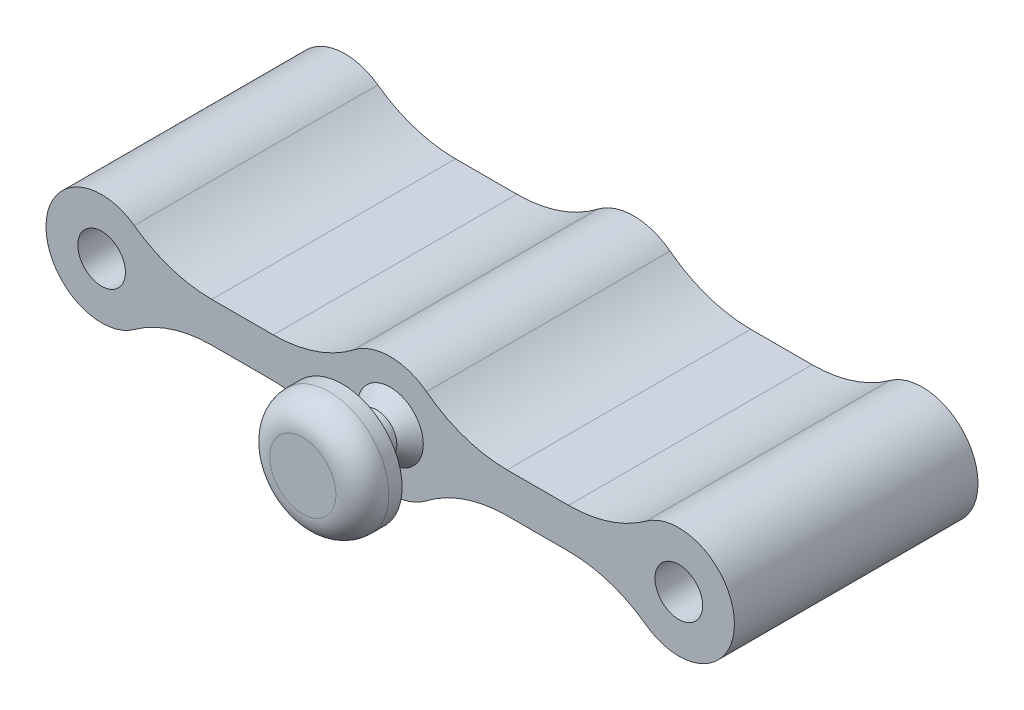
from build123d import *

# Parameters (mm, degrees)
SKETCH1_R           = 4.2
SKETCH1_R_2         = 1.8
BOSS_EXTRUDE1_DEPTH = 18.4
SKETCH2_W           = 20
SKETCH2_H           = 18.4
BOSS_EXTRUDE2_DEPTH = 1.5
SKETCH5_R           = 4.5
BOSS_EXTRUDE3_DEPTH = 18.4
SKETCH6_R           = 1.5
BOSS_EXTRUDE4_DEPTH = 3.6
BOSS_EXTRUDE5_START = 3
SKETCH7_R           = 4.5
BOSS_EXTRUDE5_DEPTH = 3
FILLET2_R           = 2
FILLET1_R           = 10
CHAMFER1_SIZE       = 1


with BuildPart() as part:
    # Sketch1 → Boss-Extrude1 (new body)
    with BuildSketch(Plane.XY.offset(0.3)):
        with Locations((-1.1688e-05, -23.499999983)):
            Circle(SKETCH1_R)
        with Locations((-1.1688e-05, -23.499999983)):
            Circle(SKETCH1_R_2, mode=Mode.SUBTRACT)
    extrude(amount=BOSS_EXTRUDE1_DEPTH)

    # Sketch2 → Boss-Extrude2 (add, symmetric)
    with BuildSketch(Plane(origin=(0, -23.499999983, 0), x_dir=(1, 0, 0), z_dir=(0, 1, 0))):
        with Locations((11.799988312, -9.5)):
            Rectangle(SKETCH2_W, SKETCH2_H)
    extrude(amount=BOSS_EXTRUDE2_DEPTH, both=True)

    # Mirror5: part across plane


with BuildPart() as part_1:
    add(part.part)
    add(part.part.mirror(Plane(origin=(21.799988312, 0, 0), x_dir=(0, 0, 1), z_dir=(1, 0, 0))))

    # Sketch5 → Boss-Extrude3 (add)
    with BuildSketch(Plane.XY.offset(18.7)):
        with Locations((21.799988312, -23.499999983)):
            Circle(SKETCH5_R)
    extrude(amount=-BOSS_EXTRUDE3_DEPTH)

    # Sketch6 → Boss-Extrude4 (add)
    with BuildSketch(Plane.XY.offset(18.7)):
        with Locations((21.799988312, -23.499999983)):
            Circle(SKETCH6_R)
    extrude(amount=BOSS_EXTRUDE4_DEPTH)

    # Sketch7 → Boss-Extrude5 (add)
    with BuildSketch(Plane.XY.offset(22.3).offset(BOSS_EXTRUDE5_START)):
        with Locations((21.799988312, -23.499999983)):
            Circle(SKETCH7_R)
    extrude(amount=-BOSS_EXTRUDE5_DEPTH)

    # Fillet2
    fillet2_edges = [part_1.edges().sort_by_distance(p)[0] for p in [
        (17.299988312, -23.499999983, 25.3),
    ]]
    fillet(fillet2_edges, radius=FILLET2_R)

    # Fillet1
    fillet1_edges = [part_1.edges().sort_by_distance(p)[0] for p in [
        (3.922997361, -24.999999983, 9.5),
        (3.922997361, -21.999999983, 9.5),
        (39.676979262, -21.999999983, 9.5),
        (39.676979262, -24.999999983, 9.5),
        (17.557347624, -24.999999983, 9.5),
        (26.042628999, -24.999999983, 9.5),
        (26.042628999, -21.999999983, 9.5),
        (17.557347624, -21.999999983, 9.5),
    ]]
    fillet(fillet1_edges, radius=FILLET1_R)

    # Chamfer1
    chamfer1_edges = [part_1.edges().sort_by_distance(p)[0] for p in [
        (20.299988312, -23.499999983, 18.7),
        (20.299988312, -23.499999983, 22.3),
    ]]
    chamfer(chamfer1_edges, length=CHAMFER1_SIZE)


solid = part_1.part
